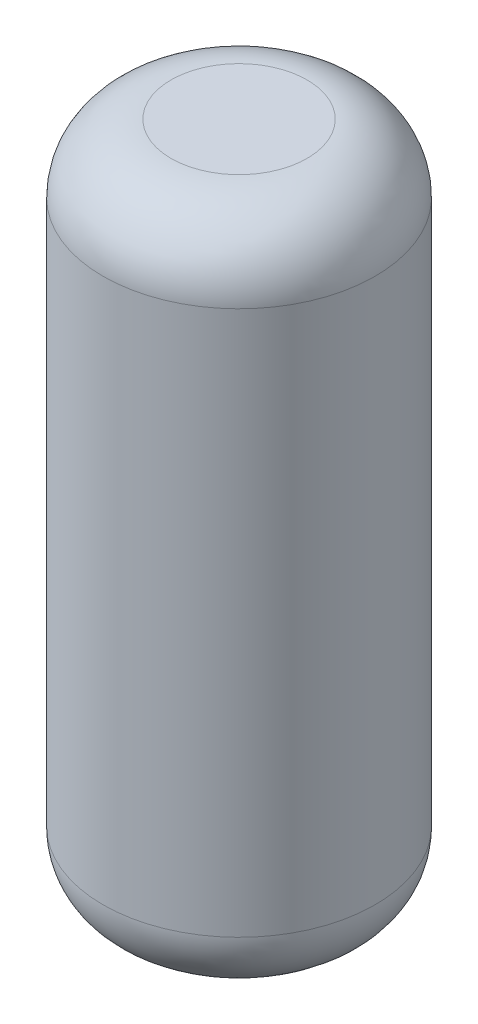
from build123d import *

# Parameters (mm, degrees)
ESQUISSE1_R        = 2
BOSS_EXTRU_1_DEPTH = 10
CONG_1_R           = 1


with BuildPart() as part:
    # Esquisse1 → Boss.-Extru.1 (new body)
    with BuildSketch(Plane(origin=(0, 0, 0), x_dir=(1, 0, 0), z_dir=(0, 1, 0))):
        with Locations(Location((0, 0, 0), (0, 0, 270))):
            Circle(ESQUISSE1_R)
    extrude(amount=BOSS_EXTRU_1_DEPTH)

    # Cong_1
    cong_1_edges = [part.edges().sort_by_distance(p)[0] for p in [
        (0, 0, -2),
        (0, 10, -2),
    ]]
    fillet(cong_1_edges, radius=CONG_1_R)


solid = part.part
